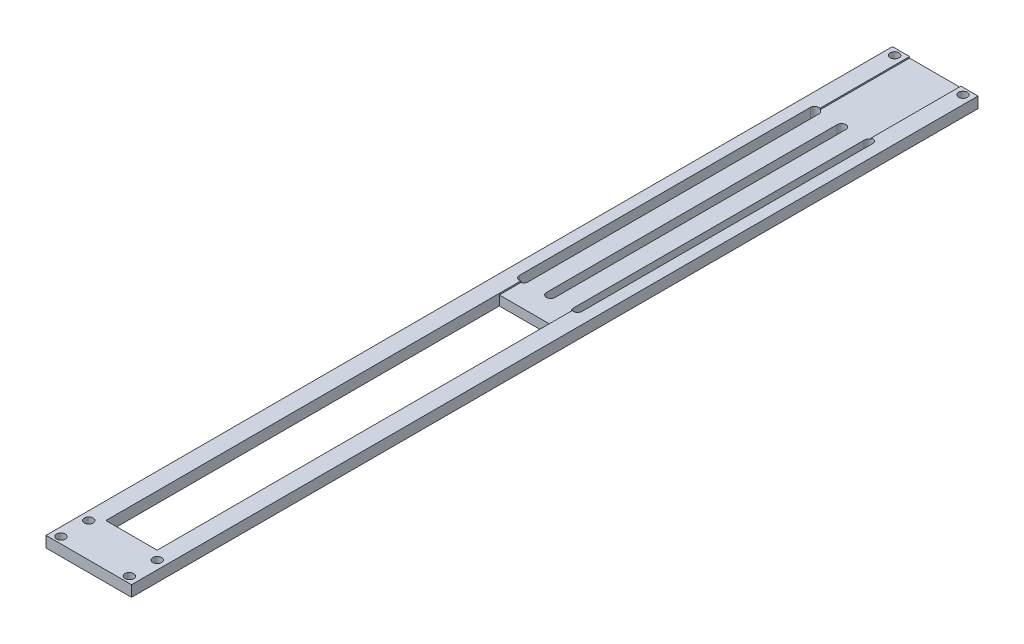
from build123d import *

# Parameters (mm, degrees)
SKETCH1_W                 = 31.75
SKETCH1_H                 = 4.064
BOSS_EXTRUDE1_DEPTH       = 314.198
SKETCH2_W                 = 19.05
SKETCH2_H                 = 146.05
CUT_EXTRUDE2_DEPTH        = 6.35
SKETCH3_W                 = 19.05
SKETCH3_H                 = 160.070755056
CUT_EXTRUDE3_DEPTH        = 0.508
F_4_CLEARANCE_HOLE1_D     = 3.2639
F_4_CLEARANCE_HOLE1_DEPTH = 25.4
F_4_CLEARANCE_HOLE1_TIP   = 0.980574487
CUT_EXTRUDE4_DEPTH        = 8.128
LPATTERN1_COUNT           = 2
LPATTERN1_PITCH           = 10
LPATTERN2_COUNT           = 2
LPATTERN2_PITCH           = 10
F_4_CLEARANCE_HOLE2_D     = 3.2639
F_4_CLEARANCE_HOLE2_DEPTH = 25.4
F_4_CLEARANCE_HOLE2_TIP   = 0.980574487


with BuildPart() as part:
    # Sketch1 → Boss-Extrude1 (new body)
    with BuildSketch(Plane.XY):
        Rectangle(SKETCH1_W, SKETCH1_H)
    extrude(amount=BOSS_EXTRUDE1_DEPTH)

    # Sketch2 → Cut-Extrude2 (cut)
    with BuildSketch(Plane(origin=(0, 2.032, 0), x_dir=(1, 0, 0), z_dir=(0, 1, 0))):
        with Locations((0, -225.298)):
            Rectangle(SKETCH2_W, SKETCH2_H)
    extrude(amount=-CUT_EXTRUDE2_DEPTH, mode=Mode.SUBTRACT)

    # Sketch3 → Cut-Extrude3 (cut)
    with BuildSketch(Plane(origin=(0, 2.032, 0), x_dir=(1, 0, 0), z_dir=(0, 1, 0))):
        with Locations((0, -72.237622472)):
            Rectangle(SKETCH3_W, SKETCH3_H)
    extrude(amount=-CUT_EXTRUDE3_DEPTH, mode=Mode.SUBTRACT)

    # 4 Clearance Hole1
    with Locations(Plane(origin=(0, 2.032, 0), x_dir=(1, 0, 0), z_dir=(0, 1, 0))):
        with Locations((12.7, -301.498), (-12.7, -301.498)):
            Hole(F_4_CLEARANCE_HOLE1_D / 2, depth=F_4_CLEARANCE_HOLE1_DEPTH)
            with Locations((0, 0, -(F_4_CLEARANCE_HOLE1_DEPTH + F_4_CLEARANCE_HOLE1_TIP / 2))):  # 118° drill point
                Cone(0, F_4_CLEARANCE_HOLE1_D / 2, F_4_CLEARANCE_HOLE1_TIP, mode=Mode.SUBTRACT)

    # Sketch6 → Cut-Extrude4 (cut)
    with BuildSketch(Plane.XZ.offset(2.032)):
        with BuildLine():
            Line((1.614488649, 142.748), (1.614488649, 34.798))
            ThreePointArc((1.614488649, 34.798), (0.014488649, 33.198), (-1.585511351, 34.798))
            Line((-1.585511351, 34.798), (-1.585511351, 142.748))
            ThreePointArc((-1.585511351, 142.748), (0.014488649, 144.348), (1.614488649, 142.748))
        make_face()
    cut_extrude4 = extrude(amount=-CUT_EXTRUDE4_DEPTH, mode=Mode.SUBTRACT)

    # LPattern1: Cut-Extrude4 ×2
    with Locations(*[(-i * LPATTERN1_PITCH, 0, 0) for i in range(1, LPATTERN1_COUNT)]):
        add(cut_extrude4, mode=Mode.SUBTRACT)

    # LPattern2: Cut-Extrude4 ×2
    with Locations(*[(i * LPATTERN2_PITCH, 0, 0) for i in range(1, LPATTERN2_COUNT)]):
        add(cut_extrude4, mode=Mode.SUBTRACT)

    # 4 Clearance Hole2
    with Locations(Plane(origin=(0, 2.032, 0), x_dir=(1, 0, 0), z_dir=(0, 1, 0))):
        with Locations((12.7, -311.81675), (-12.7, -311.81675), (12.7, -2.38125), (-12.7, -2.38125)):
            Hole(F_4_CLEARANCE_HOLE2_D / 2, depth=F_4_CLEARANCE_HOLE2_DEPTH)
            with Locations((0, 0, -(F_4_CLEARANCE_HOLE2_DEPTH + F_4_CLEARANCE_HOLE2_TIP / 2))):  # 118° drill point
                Cone(0, F_4_CLEARANCE_HOLE2_D / 2, F_4_CLEARANCE_HOLE2_TIP, mode=Mode.SUBTRACT)


solid = part.part
